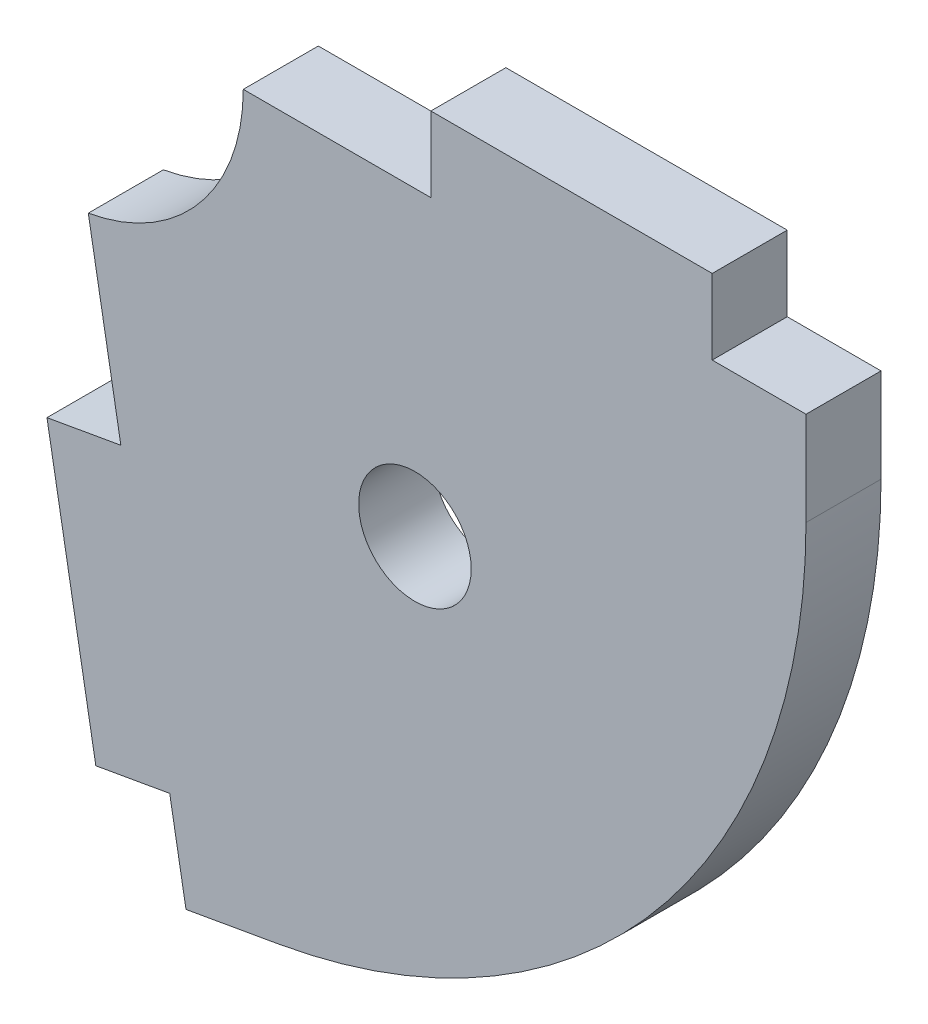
ISO-10303-21;
HEADER;
FILE_DESCRIPTION(('STEP AP214'),'2;1');
FILE_NAME('part.step','',(''),(''),'','','');
FILE_SCHEMA(('AUTOMOTIVE_DESIGN { 1 0 10303 214 1 1 1 1 }'));
ENDSEC;
DATA;
#1=APPLICATION_CONTEXT('core data for automotive mechanical design processes');
#2=APPLICATION_PROTOCOL_DEFINITION('international standard','automotive_design',2000,#1);
#3=PRODUCT_CONTEXT('',#1,'mechanical');
#4=PRODUCT('Part','Part','',(#3));
#5=PRODUCT_RELATED_PRODUCT_CATEGORY('part','',(#4));
#6=PRODUCT_DEFINITION_FORMATION('','',#4);
#7=PRODUCT_DEFINITION_CONTEXT('part definition',#1,'design');
#8=PRODUCT_DEFINITION('design','',#6,#7);
#9=PRODUCT_DEFINITION_SHAPE('','',#8);
#10=(LENGTH_UNIT() NAMED_UNIT(*) SI_UNIT(.MILLI.,.METRE.));
#11=(NAMED_UNIT(*) PLANE_ANGLE_UNIT() SI_UNIT($,.RADIAN.));
#12=(NAMED_UNIT(*) SI_UNIT($,.STERADIAN.) SOLID_ANGLE_UNIT());
#13=UNCERTAINTY_MEASURE_WITH_UNIT(LENGTH_MEASURE(1.E-05),#10,'distance_accuracy_value','');
#14=(GEOMETRIC_REPRESENTATION_CONTEXT(3) GLOBAL_UNCERTAINTY_ASSIGNED_CONTEXT((#13)) GLOBAL_UNIT_ASSIGNED_CONTEXT((#10,
#11,#12)) REPRESENTATION_CONTEXT('',''));
#15=CARTESIAN_POINT('',(0.,0.,0.));
#16=DIRECTION('',(0.,0.,1.));
#17=DIRECTION('',(1.,0.,0.));
#18=AXIS2_PLACEMENT_3D('',#15,#16,#17);
#19=CARTESIAN_POINT('',(0.,0.,4.));
#20=DIRECTION('',(0.,0.,1.));
#21=DIRECTION('',(1.,0.,0.));
#22=AXIS2_PLACEMENT_3D('',#19,#20,#21);
#23=PLANE('',#22);
#24=CARTESIAN_POINT('',(0.,0.,4.));
#25=DIRECTION('',(0.,0.,-1.));
#26=DIRECTION('',(1.,0.,0.));
#27=AXIS2_PLACEMENT_3D('',#24,#25,#26);
#28=CIRCLE('',#27,10.);
#29=CARTESIAN_POINT('',(10.,0.,4.));
#30=VERTEX_POINT('',#29);
#31=CARTESIAN_POINT('',(1.73648177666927,-9.84807753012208,4.));
#32=VERTEX_POINT('',#31);
#33=EDGE_CURVE('E192',#30,#32,#28,.T.);
#34=ORIENTED_EDGE('',*,*,#33,.T.);
#35=DIRECTION('',(0.173648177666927,-0.984807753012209,0.));
#36=VECTOR('',#35,1.);
#37=CARTESIAN_POINT('',(1.73648177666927,-9.84807753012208,4.));
#38=LINE('',#37,#36);
#39=CARTESIAN_POINT('',(3.47296355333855,-19.6961550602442,4.));
#40=VERTEX_POINT('',#39);
#41=EDGE_CURVE('E110',#32,#40,#38,.T.);
#42=ORIENTED_EDGE('',*,*,#41,.T.);
#43=DIRECTION('',(-0.984807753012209,-0.173648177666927,0.));
#44=VECTOR('',#43,1.);
#45=CARTESIAN_POINT('',(3.47296355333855,-19.6961550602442,4.));
#46=LINE('',#45,#44);
#47=CARTESIAN_POINT('',(-0.466267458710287,-20.3907477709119,4.));
#48=VERTEX_POINT('',#47);
#49=EDGE_CURVE('E225',#40,#48,#46,.T.);
#50=ORIENTED_EDGE('',*,*,#49,.T.);
#51=DIRECTION('',(0.173648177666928,-0.984807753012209,0.));
#52=VECTOR('',#51,1.);
#53=CARTESIAN_POINT('',(-0.466267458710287,-20.3907477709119,4.));
#54=LINE('',#53,#52);
#55=CARTESIAN_POINT('',(2.13845520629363,-35.162864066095,4.));
#56=VERTEX_POINT('',#55);
#57=EDGE_CURVE('E244',#48,#56,#54,.T.);
#58=ORIENTED_EDGE('',*,*,#57,.T.);
#59=DIRECTION('',(0.984807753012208,0.173648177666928,0.));
#60=VECTOR('',#59,1.);
#61=CARTESIAN_POINT('',(2.13845520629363,-35.162864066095,4.));
#62=LINE('',#61,#60);
#63=CARTESIAN_POINT('',(6.07768621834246,-34.4682713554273,4.));
#64=VERTEX_POINT('',#63);
#65=EDGE_CURVE('E241',#56,#64,#62,.T.);
#66=ORIENTED_EDGE('',*,*,#65,.T.);
#67=DIRECTION('',(0.173648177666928,-0.984807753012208,0.));
#68=VECTOR('',#67,1.);
#69=CARTESIAN_POINT('',(6.07768621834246,-34.4682713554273,4.));
#70=LINE('',#69,#68);
#71=CARTESIAN_POINT('',(6.9459271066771,-39.3923101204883,4.));
#72=VERTEX_POINT('',#71);
#73=EDGE_CURVE('E243',#64,#72,#70,.T.);
#74=ORIENTED_EDGE('',*,*,#73,.T.);
#75=DIRECTION('',(0.984807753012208,0.173648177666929,0.));
#76=VECTOR('',#75,1.);
#77=CARTESIAN_POINT('',(6.9459271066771,-39.3923101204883,4.));
#78=LINE('',#77,#76);
#79=CARTESIAN_POINT('',(11.8699658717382,-38.5240692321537,4.));
#80=VERTEX_POINT('',#79);
#81=EDGE_CURVE('E246',#72,#80,#78,.T.);
#82=ORIENTED_EDGE('',*,*,#81,.T.);
#83=CARTESIAN_POINT('',(5.95876796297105,-5.,4.));
#84=DIRECTION('',(0.,0.,1.));
#85=DIRECTION('',(-1.,0.,0.));
#86=AXIS2_PLACEMENT_3D('',#83,#84,#85);
#87=CIRCLE('',#86,34.041232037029);
#88=CARTESIAN_POINT('',(40.,-5.,4.));
#89=VERTEX_POINT('',#88);
#90=EDGE_CURVE('E252',#80,#89,#87,.T.);
#91=ORIENTED_EDGE('',*,*,#90,.T.);
#92=DIRECTION('',(0.,1.,0.));
#93=VECTOR('',#92,1.);
#94=CARTESIAN_POINT('',(40.,0.,4.));
#95=LINE('',#94,#93);
#96=CARTESIAN_POINT('',(40.,0.,4.));
#97=VERTEX_POINT('',#96);
#98=EDGE_CURVE('E254',#89,#97,#95,.T.);
#99=ORIENTED_EDGE('',*,*,#98,.T.);
#100=DIRECTION('',(-1.,0.,0.));
#101=VECTOR('',#100,1.);
#102=CARTESIAN_POINT('',(35.,0.,4.));
#103=LINE('',#102,#101);
#104=CARTESIAN_POINT('',(35.,0.,4.));
#105=VERTEX_POINT('',#104);
#106=EDGE_CURVE('E256',#97,#105,#103,.T.);
#107=ORIENTED_EDGE('',*,*,#106,.T.);
#108=DIRECTION('',(0.,1.,0.));
#109=VECTOR('',#108,1.);
#110=CARTESIAN_POINT('',(35.,4.,4.));
#111=LINE('',#110,#109);
#112=CARTESIAN_POINT('',(35.,4.,4.));
#113=VERTEX_POINT('',#112);
#114=EDGE_CURVE('E147',#105,#113,#111,.T.);
#115=ORIENTED_EDGE('',*,*,#114,.T.);
#116=DIRECTION('',(-1.,0.,0.));
#117=VECTOR('',#116,1.);
#118=CARTESIAN_POINT('',(20.,4.,4.));
#119=LINE('',#118,#117);
#120=CARTESIAN_POINT('',(20.,4.,4.));
#121=VERTEX_POINT('',#120);
#122=EDGE_CURVE('E141',#113,#121,#119,.T.);
#123=ORIENTED_EDGE('',*,*,#122,.T.);
#124=DIRECTION('',(0.,-1.,0.));
#125=VECTOR('',#124,1.);
#126=CARTESIAN_POINT('',(20.,0.,4.));
#127=LINE('',#126,#125);
#128=CARTESIAN_POINT('',(20.,0.,4.));
#129=VERTEX_POINT('',#128);
#130=EDGE_CURVE('E145',#121,#129,#127,.T.);
#131=ORIENTED_EDGE('',*,*,#130,.T.);
#132=DIRECTION('',(-1.,0.,0.));
#133=VECTOR('',#132,1.);
#134=CARTESIAN_POINT('',(10.,0.,4.));
#135=LINE('',#134,#133);
#136=EDGE_CURVE('E49',#129,#30,#135,.T.);
#137=ORIENTED_EDGE('',*,*,#136,.T.);
#138=EDGE_LOOP('',(#34,#42,#50,#58,#66,#74,#82,#91,#99,#107,#115,#123,#131,#137));
#139=FACE_BOUND('',#138,.T.);
#140=CARTESIAN_POINT('',(19.1511110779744,-16.0696902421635,4.));
#141=DIRECTION('',(0.,0.,1.));
#142=DIRECTION('',(1.,0.,0.));
#143=AXIS2_PLACEMENT_3D('',#140,#141,#142);
#144=CIRCLE('',#143,2.99999999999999);
#145=CARTESIAN_POINT('',(22.1511110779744,-16.0696902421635,4.));
#146=VERTEX_POINT('',#145);
#147=EDGE_CURVE('E169',#146,#146,#144,.T.);
#148=ORIENTED_EDGE('',*,*,#147,.F.);
#149=EDGE_LOOP('',(#148));
#150=FACE_BOUND('',#149,.T.);
#151=ADVANCED_FACE('F32',(#139,#150),#23,.T.);
#152=CARTESIAN_POINT('',(0.,0.,0.));
#153=DIRECTION('',(0.,0.,1.));
#154=DIRECTION('',(1.,0.,0.));
#155=AXIS2_PLACEMENT_3D('',#152,#153,#154);
#156=PLANE('',#155);
#157=CARTESIAN_POINT('',(0.,0.,0.));
#158=DIRECTION('',(0.,0.,-1.));
#159=DIRECTION('',(1.,0.,0.));
#160=AXIS2_PLACEMENT_3D('',#157,#158,#159);
#161=CIRCLE('',#160,10.);
#162=CARTESIAN_POINT('',(10.,0.,0.));
#163=VERTEX_POINT('',#162);
#164=CARTESIAN_POINT('',(1.73648177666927,-9.84807753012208,0.));
#165=VERTEX_POINT('',#164);
#166=EDGE_CURVE('E165',#163,#165,#161,.T.);
#167=ORIENTED_EDGE('',*,*,#166,.F.);
#168=DIRECTION('',(-1.,0.,0.));
#169=VECTOR('',#168,1.);
#170=CARTESIAN_POINT('',(10.,0.,0.));
#171=LINE('',#170,#169);
#172=CARTESIAN_POINT('',(20.,0.,0.));
#173=VERTEX_POINT('',#172);
#174=EDGE_CURVE('E102',#173,#163,#171,.T.);
#175=ORIENTED_EDGE('',*,*,#174,.F.);
#176=DIRECTION('',(0.,-1.,0.));
#177=VECTOR('',#176,1.);
#178=CARTESIAN_POINT('',(20.,0.,0.));
#179=LINE('',#178,#177);
#180=CARTESIAN_POINT('',(20.,4.,0.));
#181=VERTEX_POINT('',#180);
#182=EDGE_CURVE('E96',#181,#173,#179,.T.);
#183=ORIENTED_EDGE('',*,*,#182,.F.);
#184=DIRECTION('',(-1.,0.,0.));
#185=VECTOR('',#184,1.);
#186=CARTESIAN_POINT('',(20.,4.,0.));
#187=LINE('',#186,#185);
#188=CARTESIAN_POINT('',(35.,4.,0.));
#189=VERTEX_POINT('',#188);
#190=EDGE_CURVE('E155',#189,#181,#187,.T.);
#191=ORIENTED_EDGE('',*,*,#190,.F.);
#192=DIRECTION('',(0.,1.,0.));
#193=VECTOR('',#192,1.);
#194=CARTESIAN_POINT('',(35.,4.,0.));
#195=LINE('',#194,#193);
#196=CARTESIAN_POINT('',(35.,0.,0.));
#197=VERTEX_POINT('',#196);
#198=EDGE_CURVE('E187',#197,#189,#195,.T.);
#199=ORIENTED_EDGE('',*,*,#198,.F.);
#200=DIRECTION('',(-1.,0.,0.));
#201=VECTOR('',#200,1.);
#202=CARTESIAN_POINT('',(35.,0.,0.));
#203=LINE('',#202,#201);
#204=CARTESIAN_POINT('',(40.,0.,0.));
#205=VERTEX_POINT('',#204);
#206=EDGE_CURVE('E185',#205,#197,#203,.T.);
#207=ORIENTED_EDGE('',*,*,#206,.F.);
#208=DIRECTION('',(0.,1.,0.));
#209=VECTOR('',#208,1.);
#210=CARTESIAN_POINT('',(40.,0.,0.));
#211=LINE('',#210,#209);
#212=CARTESIAN_POINT('',(40.,-5.,0.));
#213=VERTEX_POINT('',#212);
#214=EDGE_CURVE('E183',#213,#205,#211,.T.);
#215=ORIENTED_EDGE('',*,*,#214,.F.);
#216=CARTESIAN_POINT('',(5.95876796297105,-5.,0.));
#217=DIRECTION('',(0.,0.,1.));
#218=DIRECTION('',(-1.,0.,0.));
#219=AXIS2_PLACEMENT_3D('',#216,#217,#218);
#220=CIRCLE('',#219,34.041232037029);
#221=CARTESIAN_POINT('',(11.8699658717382,-38.5240692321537,0.));
#222=VERTEX_POINT('',#221);
#223=EDGE_CURVE('E181',#222,#213,#220,.T.);
#224=ORIENTED_EDGE('',*,*,#223,.F.);
#225=DIRECTION('',(0.984807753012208,0.173648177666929,0.));
#226=VECTOR('',#225,1.);
#227=CARTESIAN_POINT('',(6.9459271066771,-39.3923101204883,0.));
#228=LINE('',#227,#226);
#229=CARTESIAN_POINT('',(6.9459271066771,-39.3923101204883,0.));
#230=VERTEX_POINT('',#229);
#231=EDGE_CURVE('E179',#230,#222,#228,.T.);
#232=ORIENTED_EDGE('',*,*,#231,.F.);
#233=DIRECTION('',(0.173648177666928,-0.984807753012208,0.));
#234=VECTOR('',#233,1.);
#235=CARTESIAN_POINT('',(6.07768621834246,-34.4682713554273,0.));
#236=LINE('',#235,#234);
#237=CARTESIAN_POINT('',(6.07768621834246,-34.4682713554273,0.));
#238=VERTEX_POINT('',#237);
#239=EDGE_CURVE('E177',#238,#230,#236,.T.);
#240=ORIENTED_EDGE('',*,*,#239,.F.);
#241=DIRECTION('',(0.984807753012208,0.173648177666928,0.));
#242=VECTOR('',#241,1.);
#243=CARTESIAN_POINT('',(2.13845520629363,-35.162864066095,0.));
#244=LINE('',#243,#242);
#245=CARTESIAN_POINT('',(2.13845520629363,-35.162864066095,0.));
#246=VERTEX_POINT('',#245);
#247=EDGE_CURVE('E175',#246,#238,#244,.T.);
#248=ORIENTED_EDGE('',*,*,#247,.F.);
#249=DIRECTION('',(0.173648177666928,-0.984807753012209,0.));
#250=VECTOR('',#249,1.);
#251=CARTESIAN_POINT('',(-0.466267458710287,-20.3907477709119,0.));
#252=LINE('',#251,#250);
#253=CARTESIAN_POINT('',(-0.466267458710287,-20.3907477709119,0.));
#254=VERTEX_POINT('',#253);
#255=EDGE_CURVE('E173',#254,#246,#252,.T.);
#256=ORIENTED_EDGE('',*,*,#255,.F.);
#257=DIRECTION('',(-0.984807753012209,-0.173648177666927,0.));
#258=VECTOR('',#257,1.);
#259=CARTESIAN_POINT('',(3.47296355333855,-19.6961550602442,0.));
#260=LINE('',#259,#258);
#261=CARTESIAN_POINT('',(3.47296355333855,-19.6961550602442,0.));
#262=VERTEX_POINT('',#261);
#263=EDGE_CURVE('E171',#262,#254,#260,.T.);
#264=ORIENTED_EDGE('',*,*,#263,.F.);
#265=DIRECTION('',(0.173648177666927,-0.984807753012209,0.));
#266=VECTOR('',#265,1.);
#267=CARTESIAN_POINT('',(1.73648177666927,-9.84807753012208,0.));
#268=LINE('',#267,#266);
#269=EDGE_CURVE('E168',#165,#262,#268,.T.);
#270=ORIENTED_EDGE('',*,*,#269,.F.);
#271=EDGE_LOOP('',(#167,#175,#183,#191,#199,#207,#215,#224,#232,#240,#248,#256,#264,#270));
#272=FACE_BOUND('',#271,.T.);
#273=CARTESIAN_POINT('',(19.1511110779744,-16.0696902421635,0.));
#274=DIRECTION('',(0.,0.,1.));
#275=DIRECTION('',(1.,0.,0.));
#276=AXIS2_PLACEMENT_3D('',#273,#274,#275);
#277=CIRCLE('',#276,2.99999999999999);
#278=CARTESIAN_POINT('',(22.1511110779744,-16.0696902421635,0.));
#279=VERTEX_POINT('',#278);
#280=EDGE_CURVE('E429',#279,#279,#277,.T.);
#281=ORIENTED_EDGE('',*,*,#280,.T.);
#282=EDGE_LOOP('',(#281));
#283=FACE_BOUND('',#282,.T.);
#284=ADVANCED_FACE('F229',(#272,#283),#156,.F.);
#285=CARTESIAN_POINT('',(0.,0.,4.));
#286=DIRECTION('',(0.,0.,-1.));
#287=DIRECTION('',(-1.,0.,0.));
#288=AXIS2_PLACEMENT_3D('',#285,#286,#287);
#289=CYLINDRICAL_SURFACE('',#288,10.);
#290=ORIENTED_EDGE('',*,*,#166,.T.);
#291=DIRECTION('',(0.,0.,-1.));
#292=VECTOR('',#291,1.);
#293=CARTESIAN_POINT('',(1.73648177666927,-9.84807753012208,4.));
#294=LINE('',#293,#292);
#295=EDGE_CURVE('E11',#32,#165,#294,.T.);
#296=ORIENTED_EDGE('',*,*,#295,.F.);
#297=ORIENTED_EDGE('',*,*,#33,.F.);
#298=DIRECTION('',(0.,0.,-1.));
#299=VECTOR('',#298,1.);
#300=CARTESIAN_POINT('',(10.,0.,4.));
#301=LINE('',#300,#299);
#302=EDGE_CURVE('E161',#30,#163,#301,.T.);
#303=ORIENTED_EDGE('',*,*,#302,.T.);
#304=EDGE_LOOP('',(#290,#296,#297,#303));
#305=FACE_BOUND('',#304,.T.);
#306=ADVANCED_FACE('F34',(#305),#289,.F.);
#307=CARTESIAN_POINT('',(1.73648177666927,-9.84807753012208,4.));
#308=DIRECTION('',(0.984807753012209,0.173648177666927,0.));
#309=DIRECTION('',(-0.173648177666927,0.984807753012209,0.));
#310=AXIS2_PLACEMENT_3D('',#307,#308,#309);
#311=PLANE('',#310);
#312=ORIENTED_EDGE('',*,*,#269,.T.);
#313=DIRECTION('',(0.,0.,-1.));
#314=VECTOR('',#313,1.);
#315=CARTESIAN_POINT('',(3.47296355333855,-19.6961550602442,4.));
#316=LINE('',#315,#314);
#317=EDGE_CURVE('E41',#40,#262,#316,.T.);
#318=ORIENTED_EDGE('',*,*,#317,.F.);
#319=ORIENTED_EDGE('',*,*,#41,.F.);
#320=ORIENTED_EDGE('',*,*,#295,.T.);
#321=EDGE_LOOP('',(#312,#318,#319,#320));
#322=FACE_BOUND('',#321,.T.);
#323=ADVANCED_FACE('F290',(#322),#311,.F.);
#324=CARTESIAN_POINT('',(3.47296355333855,-19.6961550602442,4.));
#325=DIRECTION('',(0.173648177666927,-0.984807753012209,0.));
#326=DIRECTION('',(0.984807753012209,0.173648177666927,0.));
#327=AXIS2_PLACEMENT_3D('',#324,#325,#326);
#328=PLANE('',#327);
#329=ORIENTED_EDGE('',*,*,#263,.T.);
#330=DIRECTION('',(0.,0.,-1.));
#331=VECTOR('',#330,1.);
#332=CARTESIAN_POINT('',(-0.466267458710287,-20.3907477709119,4.));
#333=LINE('',#332,#331);
#334=EDGE_CURVE('E217',#48,#254,#333,.T.);
#335=ORIENTED_EDGE('',*,*,#334,.F.);
#336=ORIENTED_EDGE('',*,*,#49,.F.);
#337=ORIENTED_EDGE('',*,*,#317,.T.);
#338=EDGE_LOOP('',(#329,#335,#336,#337));
#339=FACE_BOUND('',#338,.T.);
#340=ADVANCED_FACE('F223',(#339),#328,.F.);
#341=CARTESIAN_POINT('',(-0.466267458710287,-20.3907477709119,4.));
#342=DIRECTION('',(0.984807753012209,0.173648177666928,0.));
#343=DIRECTION('',(-0.173648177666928,0.984807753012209,0.));
#344=AXIS2_PLACEMENT_3D('',#341,#342,#343);
#345=PLANE('',#344);
#346=ORIENTED_EDGE('',*,*,#255,.T.);
#347=DIRECTION('',(0.,0.,-1.));
#348=VECTOR('',#347,1.);
#349=CARTESIAN_POINT('',(2.13845520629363,-35.162864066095,4.));
#350=LINE('',#349,#348);
#351=EDGE_CURVE('E214',#56,#246,#350,.T.);
#352=ORIENTED_EDGE('',*,*,#351,.F.);
#353=ORIENTED_EDGE('',*,*,#57,.F.);
#354=ORIENTED_EDGE('',*,*,#334,.T.);
#355=EDGE_LOOP('',(#346,#352,#353,#354));
#356=FACE_BOUND('',#355,.T.);
#357=ADVANCED_FACE('F235',(#356),#345,.F.);
#358=CARTESIAN_POINT('',(2.13845520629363,-35.162864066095,4.));
#359=DIRECTION('',(-0.173648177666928,0.984807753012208,0.));
#360=DIRECTION('',(-0.984807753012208,-0.173648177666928,0.));
#361=AXIS2_PLACEMENT_3D('',#358,#359,#360);
#362=PLANE('',#361);
#363=ORIENTED_EDGE('',*,*,#247,.T.);
#364=DIRECTION('',(0.,0.,-1.));
#365=VECTOR('',#364,1.);
#366=CARTESIAN_POINT('',(6.07768621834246,-34.4682713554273,4.));
#367=LINE('',#366,#365);
#368=EDGE_CURVE('E211',#64,#238,#367,.T.);
#369=ORIENTED_EDGE('',*,*,#368,.F.);
#370=ORIENTED_EDGE('',*,*,#65,.F.);
#371=ORIENTED_EDGE('',*,*,#351,.T.);
#372=EDGE_LOOP('',(#363,#369,#370,#371));
#373=FACE_BOUND('',#372,.T.);
#374=ADVANCED_FACE('F239',(#373),#362,.F.);
#375=CARTESIAN_POINT('',(6.07768621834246,-34.4682713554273,4.));
#376=DIRECTION('',(0.984807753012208,0.173648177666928,0.));
#377=DIRECTION('',(-0.173648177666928,0.984807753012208,0.));
#378=AXIS2_PLACEMENT_3D('',#375,#376,#377);
#379=PLANE('',#378);
#380=ORIENTED_EDGE('',*,*,#239,.T.);
#381=DIRECTION('',(0.,0.,-1.));
#382=VECTOR('',#381,1.);
#383=CARTESIAN_POINT('',(6.9459271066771,-39.3923101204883,4.));
#384=LINE('',#383,#382);
#385=EDGE_CURVE('E208',#72,#230,#384,.T.);
#386=ORIENTED_EDGE('',*,*,#385,.F.);
#387=ORIENTED_EDGE('',*,*,#73,.F.);
#388=ORIENTED_EDGE('',*,*,#368,.T.);
#389=EDGE_LOOP('',(#380,#386,#387,#388));
#390=FACE_BOUND('',#389,.T.);
#391=ADVANCED_FACE('F303',(#390),#379,.F.);
#392=CARTESIAN_POINT('',(6.9459271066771,-39.3923101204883,4.));
#393=DIRECTION('',(-0.173648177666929,0.984807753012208,0.));
#394=DIRECTION('',(-0.984807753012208,-0.173648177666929,0.));
#395=AXIS2_PLACEMENT_3D('',#392,#393,#394);
#396=PLANE('',#395);
#397=ORIENTED_EDGE('',*,*,#231,.T.);
#398=DIRECTION('',(0.,0.,-1.));
#399=VECTOR('',#398,1.);
#400=CARTESIAN_POINT('',(11.8699658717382,-38.5240692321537,4.));
#401=LINE('',#400,#399);
#402=EDGE_CURVE('E205',#80,#222,#401,.T.);
#403=ORIENTED_EDGE('',*,*,#402,.F.);
#404=ORIENTED_EDGE('',*,*,#81,.F.);
#405=ORIENTED_EDGE('',*,*,#385,.T.);
#406=EDGE_LOOP('',(#397,#403,#404,#405));
#407=FACE_BOUND('',#406,.T.);
#408=ADVANCED_FACE('F306',(#407),#396,.F.);
#409=CARTESIAN_POINT('',(5.95876796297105,-5.,4.));
#410=DIRECTION('',(0.,0.,-1.));
#411=DIRECTION('',(-1.,0.,0.));
#412=AXIS2_PLACEMENT_3D('',#409,#410,#411);
#413=CYLINDRICAL_SURFACE('',#412,34.041232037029);
#414=ORIENTED_EDGE('',*,*,#223,.T.);
#415=DIRECTION('',(0.,0.,-1.));
#416=VECTOR('',#415,1.);
#417=CARTESIAN_POINT('',(40.,-5.,4.));
#418=LINE('',#417,#416);
#419=EDGE_CURVE('E202',#89,#213,#418,.T.);
#420=ORIENTED_EDGE('',*,*,#419,.F.);
#421=ORIENTED_EDGE('',*,*,#90,.F.);
#422=ORIENTED_EDGE('',*,*,#402,.T.);
#423=EDGE_LOOP('',(#414,#420,#421,#422));
#424=FACE_BOUND('',#423,.T.);
#425=ADVANCED_FACE('F310',(#424),#413,.T.);
#426=CARTESIAN_POINT('',(40.,0.,4.));
#427=DIRECTION('',(-1.,0.,0.));
#428=DIRECTION('',(0.,0.,1.));
#429=AXIS2_PLACEMENT_3D('',#426,#427,#428);
#430=PLANE('',#429);
#431=ORIENTED_EDGE('',*,*,#214,.T.);
#432=DIRECTION('',(0.,0.,-1.));
#433=VECTOR('',#432,1.);
#434=CARTESIAN_POINT('',(40.,0.,4.));
#435=LINE('',#434,#433);
#436=EDGE_CURVE('E199',#97,#205,#435,.T.);
#437=ORIENTED_EDGE('',*,*,#436,.F.);
#438=ORIENTED_EDGE('',*,*,#98,.F.);
#439=ORIENTED_EDGE('',*,*,#419,.T.);
#440=EDGE_LOOP('',(#431,#437,#438,#439));
#441=FACE_BOUND('',#440,.T.);
#442=ADVANCED_FACE('F314',(#441),#430,.F.);
#443=CARTESIAN_POINT('',(35.,0.,4.));
#444=DIRECTION('',(0.,-1.,0.));
#445=DIRECTION('',(0.,0.,-1.));
#446=AXIS2_PLACEMENT_3D('',#443,#444,#445);
#447=PLANE('',#446);
#448=ORIENTED_EDGE('',*,*,#206,.T.);
#449=DIRECTION('',(0.,0.,-1.));
#450=VECTOR('',#449,1.);
#451=CARTESIAN_POINT('',(35.,0.,4.));
#452=LINE('',#451,#450);
#453=EDGE_CURVE('E196',#105,#197,#452,.T.);
#454=ORIENTED_EDGE('',*,*,#453,.F.);
#455=ORIENTED_EDGE('',*,*,#106,.F.);
#456=ORIENTED_EDGE('',*,*,#436,.T.);
#457=EDGE_LOOP('',(#448,#454,#455,#456));
#458=FACE_BOUND('',#457,.T.);
#459=ADVANCED_FACE('F262',(#458),#447,.F.);
#460=CARTESIAN_POINT('',(35.,4.,4.));
#461=DIRECTION('',(-1.,0.,0.));
#462=DIRECTION('',(0.,0.,1.));
#463=AXIS2_PLACEMENT_3D('',#460,#461,#462);
#464=PLANE('',#463);
#465=ORIENTED_EDGE('',*,*,#198,.T.);
#466=DIRECTION('',(0.,0.,-1.));
#467=VECTOR('',#466,1.);
#468=CARTESIAN_POINT('',(35.,4.,4.));
#469=LINE('',#468,#467);
#470=EDGE_CURVE('E156',#113,#189,#469,.T.);
#471=ORIENTED_EDGE('',*,*,#470,.F.);
#472=ORIENTED_EDGE('',*,*,#114,.F.);
#473=ORIENTED_EDGE('',*,*,#453,.T.);
#474=EDGE_LOOP('',(#465,#471,#472,#473));
#475=FACE_BOUND('',#474,.T.);
#476=ADVANCED_FACE('F266',(#475),#464,.F.);
#477=CARTESIAN_POINT('',(20.,4.,4.));
#478=DIRECTION('',(0.,-1.,0.));
#479=DIRECTION('',(0.,0.,-1.));
#480=AXIS2_PLACEMENT_3D('',#477,#478,#479);
#481=PLANE('',#480);
#482=ORIENTED_EDGE('',*,*,#190,.T.);
#483=DIRECTION('',(0.,0.,-1.));
#484=VECTOR('',#483,1.);
#485=CARTESIAN_POINT('',(20.,4.,4.));
#486=LINE('',#485,#484);
#487=EDGE_CURVE('E152',#121,#181,#486,.T.);
#488=ORIENTED_EDGE('',*,*,#487,.F.);
#489=ORIENTED_EDGE('',*,*,#122,.F.);
#490=ORIENTED_EDGE('',*,*,#470,.T.);
#491=EDGE_LOOP('',(#482,#488,#489,#490));
#492=FACE_BOUND('',#491,.T.);
#493=ADVANCED_FACE('F153',(#492),#481,.F.);
#494=CARTESIAN_POINT('',(20.,0.,4.));
#495=DIRECTION('',(1.,0.,0.));
#496=DIRECTION('',(0.,0.,-1.));
#497=AXIS2_PLACEMENT_3D('',#494,#495,#496);
#498=PLANE('',#497);
#499=ORIENTED_EDGE('',*,*,#182,.T.);
#500=DIRECTION('',(0.,0.,-1.));
#501=VECTOR('',#500,1.);
#502=CARTESIAN_POINT('',(20.,0.,4.));
#503=LINE('',#502,#501);
#504=EDGE_CURVE('E157',#129,#173,#503,.T.);
#505=ORIENTED_EDGE('',*,*,#504,.F.);
#506=ORIENTED_EDGE('',*,*,#130,.F.);
#507=ORIENTED_EDGE('',*,*,#487,.T.);
#508=EDGE_LOOP('',(#499,#505,#506,#507));
#509=FACE_BOUND('',#508,.T.);
#510=ADVANCED_FACE('F159',(#509),#498,.F.);
#511=CARTESIAN_POINT('',(10.,0.,4.));
#512=DIRECTION('',(0.,-1.,0.));
#513=DIRECTION('',(0.,0.,-1.));
#514=AXIS2_PLACEMENT_3D('',#511,#512,#513);
#515=PLANE('',#514);
#516=ORIENTED_EDGE('',*,*,#174,.T.);
#517=ORIENTED_EDGE('',*,*,#302,.F.);
#518=ORIENTED_EDGE('',*,*,#136,.F.);
#519=ORIENTED_EDGE('',*,*,#504,.T.);
#520=EDGE_LOOP('',(#516,#517,#518,#519));
#521=FACE_BOUND('',#520,.T.);
#522=ADVANCED_FACE('F270',(#521),#515,.F.);
#523=CARTESIAN_POINT('',(19.1511110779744,-16.0696902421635,4.));
#524=DIRECTION('',(0.,0.,-1.));
#525=DIRECTION('',(-1.,0.,0.));
#526=AXIS2_PLACEMENT_3D('',#523,#524,#525);
#527=CYLINDRICAL_SURFACE('',#526,2.99999999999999);
#528=ORIENTED_EDGE('',*,*,#147,.T.);
#529=EDGE_LOOP('',(#528));
#530=FACE_BOUND('',#529,.T.);
#531=ORIENTED_EDGE('',*,*,#280,.F.);
#532=EDGE_LOOP('',(#531));
#533=FACE_BOUND('',#532,.T.);
#534=ADVANCED_FACE('F272',(#530,#533),#527,.F.);
#535=CLOSED_SHELL('',(#151,#284,#306,#323,#340,#357,#374,#391,#408,#425,#442,#459,#476,#493,
#510,#522,#534));
#536=MANIFOLD_SOLID_BREP('B2',#535);
#537=ADVANCED_BREP_SHAPE_REPRESENTATION('',(#18,#536),#14);
#538=SHAPE_DEFINITION_REPRESENTATION(#9,#537);
ENDSEC;
END-ISO-10303-21;
